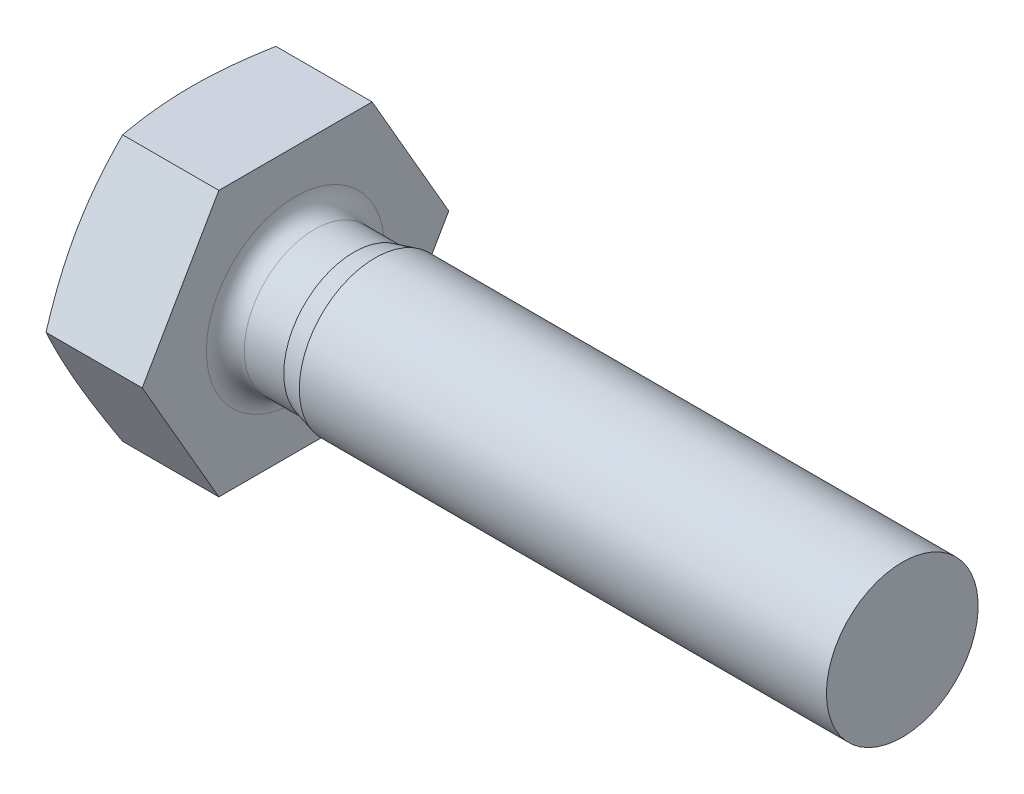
from build123d import *

# Parameters (mm, degrees)
BASEHEAD_DEPTH     = 2.8
SKETCH6_R          = 3.32
CUT_EXTRUDE1_DEPTH = 1.8
CUT_EXTRUDE2_DEPTH = 0.386
CIRPATTERN2_COUNT  = 2
CIRPATTERN2_ANGLE  = 90


with BuildPart() as part:
    # Sketch2 → BaseHead (new body)
    with BuildSketch(Plane(origin=(0, 0, 0), x_dir=(0, 0, -1), z_dir=(1, 0, 0))):
        Polygon((2.020725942, -3.5), (4.041451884, 0), (2.020725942, 3.5), (-2.020725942, 3.5), (-4.041451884, 0), (-2.020725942, -3.5), align=None)
    extrude(amount=BASEHEAD_DEPTH)

    # Sketch10 → Revolve1 (revolve)
    with BuildSketch(Plane(origin=(0, 0, 0), x_dir=(1, 0, 0), z_dir=(0, 1, 0)), mode=Mode.PRIVATE) as revolve1_sk:
        with BuildLine():
            Line((2.8, 2.35), (2.8, 0))
            Line((2.8, 0), (18.8, 0))
            Line((18.8, 0), (18.8, 2))
            Line((18.8, 2), (4.9, 2))
            Line((4.9, 2), (4.340192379, 1.85))
            Line((4.340192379, 1.85), (3.3, 1.85))
            ThreePointArc((3.3, 1.85), (2.946446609, 1.996446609), (2.8, 2.35))
        make_face()
    revolve(revolve1_sk.sketch.rotate(Axis((0, 0, 0), (1, 0, 0)), 180), axis=Axis((0, 0, 0), (1, 0, 0)))

    # Sketch5 → HeadChamfer (revolve, cut)
    with BuildSketch(Plane(origin=(0, 0, 0), x_dir=(1, 0, 0), z_dir=(0, 1, 0)), mode=Mode.PRIVATE) as headchamfer_sk:
        Polygon((0, 4.041451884), (0.262587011, 4.041451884), (0, 3.32), align=None)
    revolve(headchamfer_sk.sketch.rotate(Axis((-0.358389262, 0, 0), (1, 0, 0)), 180), axis=Axis((-0.358389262, 0, 0), (1, 0, 0)), mode=Mode.SUBTRACT)

    # Sketch6 → Cut-Extrude1 (cut)
    with BuildSketch(Plane.ZY):
        Circle(SKETCH6_R)
    extrude(amount=-CUT_EXTRUDE1_DEPTH, mode=Mode.SUBTRACT)

    # Sketch7 → Cut-Extrude2 (cut, symmetric)
    with BuildSketch(Plane(origin=(0, 0, 0), x_dir=(1, 0, 0), z_dir=(0, 1, 0))):
        Polygon((3.73, 0), (1.3, 2.518134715), (1.3, -2.518134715), align=None)
    cut_extrude2 = extrude(amount=CUT_EXTRUDE2_DEPTH, both=True, mode=Mode.SUBTRACT)

    # CirPattern2: Cut-Extrude2 ×2 about axis
    cirpattern2_axis = Axis((0, 0, 0), (-1, 0, 0))
    for i in range(1, CIRPATTERN2_COUNT):
        add(cut_extrude2.rotate(cirpattern2_axis, i * CIRPATTERN2_ANGLE / (CIRPATTERN2_COUNT - 1)), mode=Mode.SUBTRACT)


solid = part.part
